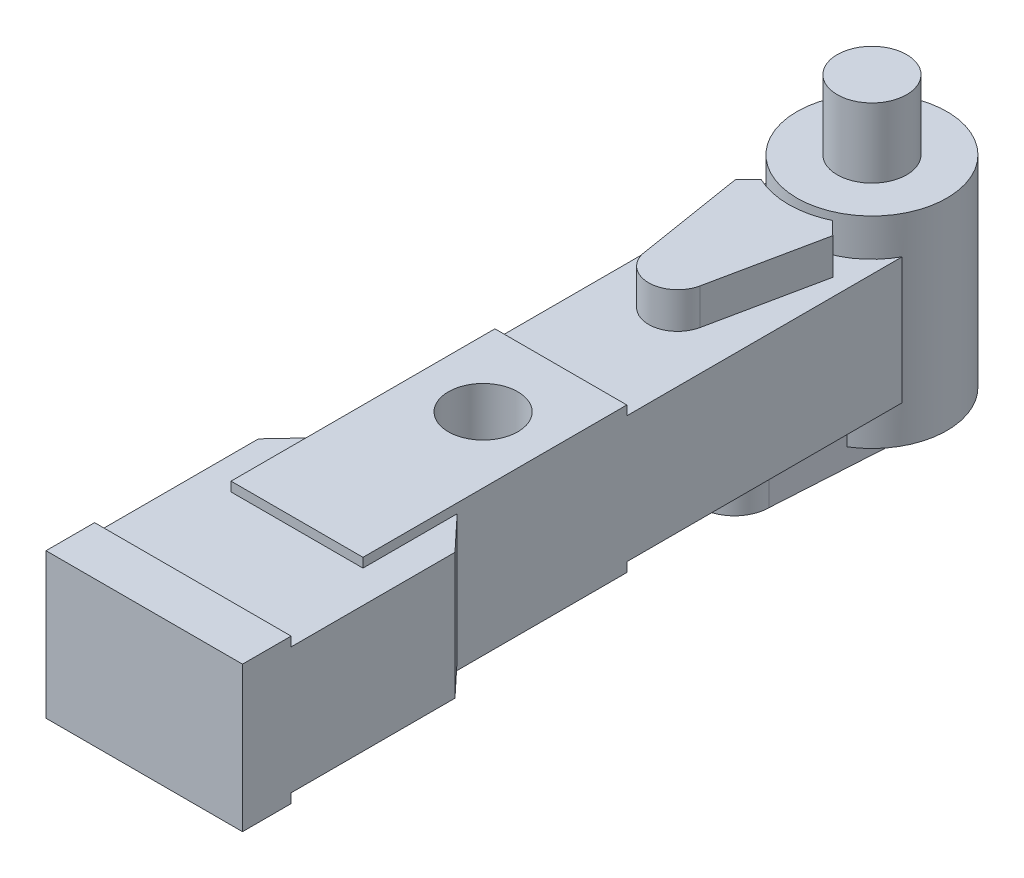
from build123d import *

# Parameters (mm, degrees)
EXTRUDE1_DEPTH     = 45.5
SKETCH3_W          = 141.5
SKETCH3_H          = 35
SKETCH3_W_2        = 95
SKETCH3_H_2        = 190
EXTRUDE2_DEPTH     = 52.25
SKETCH4_R          = 54
EXTRUDE3_DEPTH     = 72.5
EXTRUDE4_DEPTH     = 40
SKETCH6_R          = 25
CUT_EXTRUDE1_DEPTH = 50
SKETCH7_R          = 25
EXTRUDE5_DEPTH     = 50
EXTRUDE10_DEPTH    = 26


with BuildPart() as part:
    # Sketch1 → Extrude1 (new, symmetric)
    with BuildSketch(Plane(origin=(0, 0, 0), x_dir=(1, 0, 0), z_dir=(0, 1, 0))):
        with BuildLine():
            Line((-47.5, 177.808012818), (-70.75, 153))
            Line((-70.75, 153), (-70.75, 0))
            Line((-70.75, 0), (70.75, 0))
            Line((70.75, 0), (70.75, 153))
            Line((70.75, 153), (47.5, 177.808012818))
            Line((47.5, 177.808012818), (47.5, 498.314400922))
            ThreePointArc((47.5, 498.314400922), (0, 578), (-47.5, 498.314400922))
            Line((-47.5, 498.314400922), (-47.5, 177.808012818))
        make_face()
    extrude(amount=EXTRUDE1_DEPTH, both=True)

    # Sketch3 → Extrude2 (add, symmetric)
    with BuildSketch(Plane(origin=(0, 0, 0), x_dir=(1, 0, 0), z_dir=(0, 1, 0))):
        with Locations((0, 17.5)):
            Rectangle(SKETCH3_W, SKETCH3_H)
        with Locations((0, 205)):
            Rectangle(SKETCH3_W_2, SKETCH3_H_2)
    extrude(amount=EXTRUDE2_DEPTH, both=True)

    # Sketch4 → Extrude3 (add, symmetric)
    with BuildSketch(Plane(origin=(0, 0, 0), x_dir=(1, 0, 0), z_dir=(0, 1, 0))):
        with Locations(Location((0, 524, 0), (0, 0, 208.402281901))):
            Circle(SKETCH4_R)
    extrude(amount=EXTRUDE3_DEPTH, both=True)

    # Sketch5 → Extrude4 (add)
    with BuildSketch(Plane.XZ.offset(45.5)):
        with BuildLine():
            Line((30.777976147, -520.296463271), (25, -425.000002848))
            ThreePointArc((25, -425.000002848), (1.424e-06, -400), (-25, -425))
            Line((-25, -425), (-30.777976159, -520.296463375))
            ThreePointArc((-30.777976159, -520.296463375), (5.3e-08, -555), (30.777976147, -520.296463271))
        make_face()
    extrude(amount=EXTRUDE4_DEPTH)

    # Sketch6 → Cut-Extrude1 (cut)
    with BuildSketch(Plane(origin=(0, 52.25, 0), x_dir=(-1, 0, 0), z_dir=(0, 1, 0))):
        with Locations(Location((0, -244, 0), (0, 0, 90))):
            Circle(SKETCH6_R)
    extrude(amount=-CUT_EXTRUDE1_DEPTH, mode=Mode.SUBTRACT)

    # Sketch7 → Extrude5 (add)
    with BuildSketch(Plane(origin=(0, 72.5, 0), x_dir=(-1, 0, 0), z_dir=(0, 1, 0))):
        with Locations(Location((0, -524, 0), (0, 0, 90))):
            Circle(SKETCH7_R)
    extrude(amount=EXTRUDE5_DEPTH)

    # Sketch8 → Extrude10 (add)
    with BuildSketch(Plane(origin=(0, 45.5, 0), x_dir=(-1, 0, 0), z_dir=(0, 1, 0))):
        with BuildLine():
            Line((-25.70223512, -469.783811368), (-35.29776488, -460.490815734))
            Line((-35.29776488, -460.490815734), (-18.855538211, -381.414776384))
            ThreePointArc((-18.855538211, -381.414776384), (1.120629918, -364.789069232), (21.822626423, -380.501763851))
            Line((21.822626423, -380.501763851), (34.70223512, -460.490815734))
            Line((34.70223512, -460.490815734), (25.70223512, -469.783811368))
            ThreePointArc((25.70223512, -469.783811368), (0, -464), (-25.70223512, -469.783811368))
        make_face()
    extrude(amount=EXTRUDE10_DEPTH)


solid = part.part
